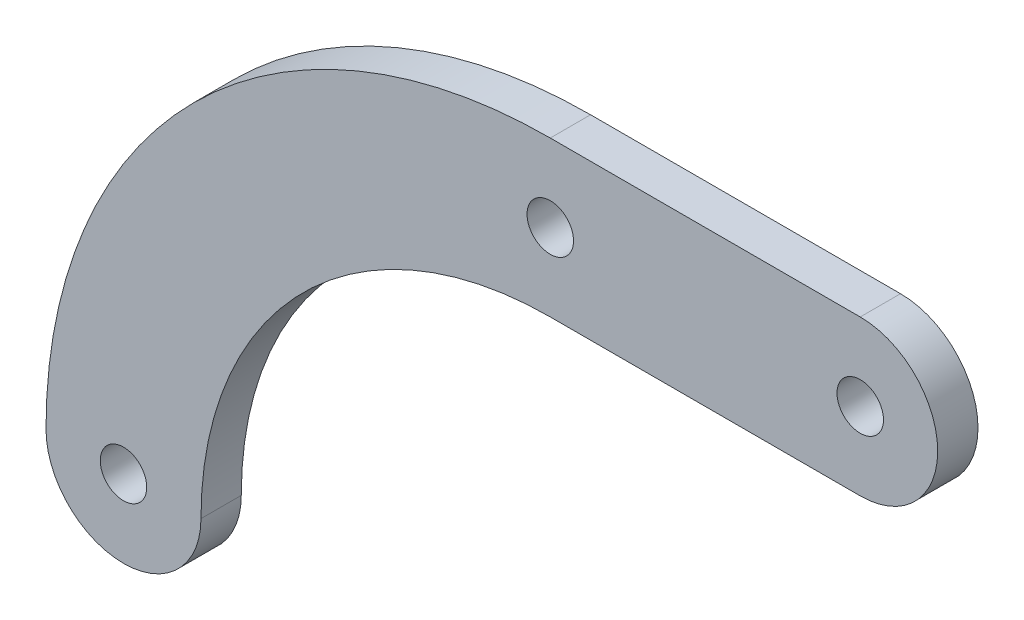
ISO-10303-21;
HEADER;
FILE_DESCRIPTION(('STEP AP214'),'2;1');
FILE_NAME('part.step','',(''),(''),'','','');
FILE_SCHEMA(('AUTOMOTIVE_DESIGN { 1 0 10303 214 1 1 1 1 }'));
ENDSEC;
DATA;
#1=APPLICATION_CONTEXT('core data for automotive mechanical design processes');
#2=APPLICATION_PROTOCOL_DEFINITION('international standard','automotive_design',2000,#1);
#3=PRODUCT_CONTEXT('',#1,'mechanical');
#4=PRODUCT('Part','Part','',(#3));
#5=PRODUCT_RELATED_PRODUCT_CATEGORY('part','',(#4));
#6=PRODUCT_DEFINITION_FORMATION('','',#4);
#7=PRODUCT_DEFINITION_CONTEXT('part definition',#1,'design');
#8=PRODUCT_DEFINITION('design','',#6,#7);
#9=PRODUCT_DEFINITION_SHAPE('','',#8);
#10=(LENGTH_UNIT() NAMED_UNIT(*) SI_UNIT(.MILLI.,.METRE.));
#11=(NAMED_UNIT(*) PLANE_ANGLE_UNIT() SI_UNIT($,.RADIAN.));
#12=(NAMED_UNIT(*) SI_UNIT($,.STERADIAN.) SOLID_ANGLE_UNIT());
#13=UNCERTAINTY_MEASURE_WITH_UNIT(LENGTH_MEASURE(1.E-05),#10,'distance_accuracy_value','');
#14=(GEOMETRIC_REPRESENTATION_CONTEXT(3) GLOBAL_UNCERTAINTY_ASSIGNED_CONTEXT((#13)) GLOBAL_UNIT_ASSIGNED_CONTEXT((#10,
#11,#12)) REPRESENTATION_CONTEXT('',''));
#15=CARTESIAN_POINT('',(0.,0.,0.));
#16=DIRECTION('',(0.,0.,1.));
#17=DIRECTION('',(1.,0.,0.));
#18=AXIS2_PLACEMENT_3D('',#15,#16,#17);
#19=CARTESIAN_POINT('',(-27.54,0.,2.6));
#20=DIRECTION('',(0.,0.,1.));
#21=DIRECTION('',(1.,0.,0.));
#22=AXIS2_PLACEMENT_3D('',#19,#20,#21);
#23=PLANE('',#22);
#24=CARTESIAN_POINT('',(-27.54,0.,2.6));
#25=DIRECTION('',(0.,0.,1.));
#26=DIRECTION('',(1.,0.,0.));
#27=AXIS2_PLACEMENT_3D('',#24,#25,#26);
#28=CIRCLE('',#27,1.5);
#29=CARTESIAN_POINT('',(-26.04,0.,2.6));
#30=VERTEX_POINT('',#29);
#31=EDGE_CURVE('E184',#30,#30,#28,.T.);
#32=ORIENTED_EDGE('',*,*,#31,.F.);
#33=EDGE_LOOP('',(#32));
#34=FACE_BOUND('',#33,.T.);
#35=CARTESIAN_POINT('',(-27.54,0.,2.6));
#36=DIRECTION('',(0.,0.,1.));
#37=DIRECTION('',(1.,0.,0.));
#38=AXIS2_PLACEMENT_3D('',#35,#36,#37);
#39=CIRCLE('',#38,5.);
#40=CARTESIAN_POINT('',(-32.54,0.,2.6));
#41=VERTEX_POINT('',#40);
#42=CARTESIAN_POINT('',(-22.54,0.,2.6));
#43=VERTEX_POINT('',#42);
#44=EDGE_CURVE('E129',#41,#43,#39,.T.);
#45=ORIENTED_EDGE('',*,*,#44,.T.);
#46=CARTESIAN_POINT('',(0.,0.,2.6));
#47=DIRECTION('',(0.,0.,-1.));
#48=DIRECTION('',(1.,0.,0.));
#49=AXIS2_PLACEMENT_3D('',#46,#47,#48);
#50=CIRCLE('',#49,22.54);
#51=CARTESIAN_POINT('',(0.,22.54,2.6));
#52=VERTEX_POINT('',#51);
#53=EDGE_CURVE('E87',#43,#52,#50,.T.);
#54=ORIENTED_EDGE('',*,*,#53,.T.);
#55=DIRECTION('',(1.,0.,0.));
#56=VECTOR('',#55,1.);
#57=CARTESIAN_POINT('',(0.,22.54,2.6));
#58=LINE('',#57,#56);
#59=CARTESIAN_POINT('',(20.,22.54,2.6));
#60=VERTEX_POINT('',#59);
#61=EDGE_CURVE('E100',#52,#60,#58,.T.);
#62=ORIENTED_EDGE('',*,*,#61,.T.);
#63=CARTESIAN_POINT('',(20.,27.54,2.6));
#64=DIRECTION('',(0.,0.,1.));
#65=DIRECTION('',(1.,0.,0.));
#66=AXIS2_PLACEMENT_3D('',#63,#64,#65);
#67=CIRCLE('',#66,5.);
#68=CARTESIAN_POINT('',(20.,32.54,2.6));
#69=VERTEX_POINT('',#68);
#70=EDGE_CURVE('E94',#60,#69,#67,.T.);
#71=ORIENTED_EDGE('',*,*,#70,.T.);
#72=DIRECTION('',(-1.,0.,0.));
#73=VECTOR('',#72,1.);
#74=CARTESIAN_POINT('',(0.,32.54,2.6));
#75=LINE('',#74,#73);
#76=CARTESIAN_POINT('',(0.,32.54,2.6));
#77=VERTEX_POINT('',#76);
#78=EDGE_CURVE('E98',#69,#77,#75,.T.);
#79=ORIENTED_EDGE('',*,*,#78,.T.);
#80=CARTESIAN_POINT('',(0.,0.,2.6));
#81=DIRECTION('',(0.,0.,1.));
#82=DIRECTION('',(1.,0.,0.));
#83=AXIS2_PLACEMENT_3D('',#80,#81,#82);
#84=CIRCLE('',#83,32.54);
#85=EDGE_CURVE('E50',#77,#41,#84,.T.);
#86=ORIENTED_EDGE('',*,*,#85,.T.);
#87=EDGE_LOOP('',(#45,#54,#62,#71,#79,#86));
#88=FACE_BOUND('',#87,.T.);
#89=CARTESIAN_POINT('',(0.,27.54,2.6));
#90=DIRECTION('',(0.,0.,1.));
#91=DIRECTION('',(1.,0.,0.));
#92=AXIS2_PLACEMENT_3D('',#89,#90,#91);
#93=CIRCLE('',#92,1.5);
#94=CARTESIAN_POINT('',(1.5,27.54,2.6));
#95=VERTEX_POINT('',#94);
#96=EDGE_CURVE('E122',#95,#95,#93,.T.);
#97=ORIENTED_EDGE('',*,*,#96,.F.);
#98=EDGE_LOOP('',(#97));
#99=FACE_BOUND('',#98,.T.);
#100=CARTESIAN_POINT('',(20.,27.54,2.6));
#101=DIRECTION('',(0.,0.,1.));
#102=DIRECTION('',(1.,0.,0.));
#103=AXIS2_PLACEMENT_3D('',#100,#101,#102);
#104=CIRCLE('',#103,1.5);
#105=CARTESIAN_POINT('',(21.5,27.54,2.6));
#106=VERTEX_POINT('',#105);
#107=EDGE_CURVE('E175',#106,#106,#104,.T.);
#108=ORIENTED_EDGE('',*,*,#107,.F.);
#109=EDGE_LOOP('',(#108));
#110=FACE_BOUND('',#109,.T.);
#111=ADVANCED_FACE('F33',(#34,#88,#99,#110),#23,.T.);
#112=CARTESIAN_POINT('',(-27.54,0.,0.));
#113=DIRECTION('',(0.,0.,1.));
#114=DIRECTION('',(1.,0.,0.));
#115=AXIS2_PLACEMENT_3D('',#112,#113,#114);
#116=PLANE('',#115);
#117=CARTESIAN_POINT('',(-27.54,0.,0.));
#118=DIRECTION('',(0.,0.,1.));
#119=DIRECTION('',(1.,0.,0.));
#120=AXIS2_PLACEMENT_3D('',#117,#118,#119);
#121=CIRCLE('',#120,5.);
#122=CARTESIAN_POINT('',(-32.54,0.,0.));
#123=VERTEX_POINT('',#122);
#124=CARTESIAN_POINT('',(-22.54,0.,0.));
#125=VERTEX_POINT('',#124);
#126=EDGE_CURVE('E118',#123,#125,#121,.T.);
#127=ORIENTED_EDGE('',*,*,#126,.F.);
#128=CARTESIAN_POINT('',(0.,0.,0.));
#129=DIRECTION('',(0.,0.,1.));
#130=DIRECTION('',(1.,0.,0.));
#131=AXIS2_PLACEMENT_3D('',#128,#129,#130);
#132=CIRCLE('',#131,32.54);
#133=CARTESIAN_POINT('',(0.,32.54,0.));
#134=VERTEX_POINT('',#133);
#135=EDGE_CURVE('E79',#134,#123,#132,.T.);
#136=ORIENTED_EDGE('',*,*,#135,.F.);
#137=DIRECTION('',(-1.,0.,0.));
#138=VECTOR('',#137,1.);
#139=CARTESIAN_POINT('',(0.,32.54,0.));
#140=LINE('',#139,#138);
#141=CARTESIAN_POINT('',(20.,32.54,0.));
#142=VERTEX_POINT('',#141);
#143=EDGE_CURVE('E73',#142,#134,#140,.T.);
#144=ORIENTED_EDGE('',*,*,#143,.F.);
#145=CARTESIAN_POINT('',(20.,27.54,0.));
#146=DIRECTION('',(0.,0.,1.));
#147=DIRECTION('',(1.,0.,0.));
#148=AXIS2_PLACEMENT_3D('',#145,#146,#147);
#149=CIRCLE('',#148,5.);
#150=CARTESIAN_POINT('',(20.,22.54,0.));
#151=VERTEX_POINT('',#150);
#152=EDGE_CURVE('E108',#151,#142,#149,.T.);
#153=ORIENTED_EDGE('',*,*,#152,.F.);
#154=DIRECTION('',(1.,0.,0.));
#155=VECTOR('',#154,1.);
#156=CARTESIAN_POINT('',(0.,22.54,0.));
#157=LINE('',#156,#155);
#158=CARTESIAN_POINT('',(0.,22.54,0.));
#159=VERTEX_POINT('',#158);
#160=EDGE_CURVE('E124',#159,#151,#157,.T.);
#161=ORIENTED_EDGE('',*,*,#160,.F.);
#162=CARTESIAN_POINT('',(0.,0.,0.));
#163=DIRECTION('',(0.,0.,-1.));
#164=DIRECTION('',(1.,0.,0.));
#165=AXIS2_PLACEMENT_3D('',#162,#163,#164);
#166=CIRCLE('',#165,22.54);
#167=EDGE_CURVE('E121',#125,#159,#166,.T.);
#168=ORIENTED_EDGE('',*,*,#167,.F.);
#169=EDGE_LOOP('',(#127,#136,#144,#153,#161,#168));
#170=FACE_BOUND('',#169,.T.);
#171=CARTESIAN_POINT('',(0.,27.54,0.));
#172=DIRECTION('',(0.,0.,1.));
#173=DIRECTION('',(1.,0.,0.));
#174=AXIS2_PLACEMENT_3D('',#171,#172,#173);
#175=CIRCLE('',#174,1.5);
#176=CARTESIAN_POINT('',(1.5,27.54,0.));
#177=VERTEX_POINT('',#176);
#178=EDGE_CURVE('E187',#177,#177,#175,.T.);
#179=ORIENTED_EDGE('',*,*,#178,.T.);
#180=EDGE_LOOP('',(#179));
#181=FACE_BOUND('',#180,.T.);
#182=CARTESIAN_POINT('',(-27.54,0.,0.));
#183=DIRECTION('',(0.,0.,1.));
#184=DIRECTION('',(1.,0.,0.));
#185=AXIS2_PLACEMENT_3D('',#182,#183,#184);
#186=CIRCLE('',#185,1.5);
#187=CARTESIAN_POINT('',(-26.04,0.,0.));
#188=VERTEX_POINT('',#187);
#189=EDGE_CURVE('E181',#188,#188,#186,.T.);
#190=ORIENTED_EDGE('',*,*,#189,.T.);
#191=EDGE_LOOP('',(#190));
#192=FACE_BOUND('',#191,.T.);
#193=CARTESIAN_POINT('',(20.,27.54,0.));
#194=DIRECTION('',(0.,0.,1.));
#195=DIRECTION('',(1.,0.,0.));
#196=AXIS2_PLACEMENT_3D('',#193,#194,#195);
#197=CIRCLE('',#196,1.5);
#198=CARTESIAN_POINT('',(21.5,27.54,0.));
#199=VERTEX_POINT('',#198);
#200=EDGE_CURVE('E178',#199,#199,#197,.T.);
#201=ORIENTED_EDGE('',*,*,#200,.T.);
#202=EDGE_LOOP('',(#201));
#203=FACE_BOUND('',#202,.T.);
#204=ADVANCED_FACE('F138',(#170,#181,#192,#203),#116,.F.);
#205=CARTESIAN_POINT('',(-27.54,0.,2.6));
#206=DIRECTION('',(0.,0.,-1.));
#207=DIRECTION('',(-1.,0.,0.));
#208=AXIS2_PLACEMENT_3D('',#205,#206,#207);
#209=CYLINDRICAL_SURFACE('',#208,5.);
#210=ORIENTED_EDGE('',*,*,#126,.T.);
#211=DIRECTION('',(0.,0.,-1.));
#212=VECTOR('',#211,1.);
#213=CARTESIAN_POINT('',(-22.54,0.,2.6));
#214=LINE('',#213,#212);
#215=EDGE_CURVE('E11',#43,#125,#214,.T.);
#216=ORIENTED_EDGE('',*,*,#215,.F.);
#217=ORIENTED_EDGE('',*,*,#44,.F.);
#218=DIRECTION('',(0.,0.,-1.));
#219=VECTOR('',#218,1.);
#220=CARTESIAN_POINT('',(-32.54,0.,2.6));
#221=LINE('',#220,#219);
#222=EDGE_CURVE('E114',#41,#123,#221,.T.);
#223=ORIENTED_EDGE('',*,*,#222,.T.);
#224=EDGE_LOOP('',(#210,#216,#217,#223));
#225=FACE_BOUND('',#224,.T.);
#226=ADVANCED_FACE('F35',(#225),#209,.T.);
#227=CARTESIAN_POINT('',(0.,0.,2.6));
#228=DIRECTION('',(0.,0.,-1.));
#229=DIRECTION('',(-1.,0.,0.));
#230=AXIS2_PLACEMENT_3D('',#227,#228,#229);
#231=CYLINDRICAL_SURFACE('',#230,22.54);
#232=ORIENTED_EDGE('',*,*,#167,.T.);
#233=DIRECTION('',(0.,0.,-1.));
#234=VECTOR('',#233,1.);
#235=CARTESIAN_POINT('',(0.,22.54,2.6));
#236=LINE('',#235,#234);
#237=EDGE_CURVE('E42',#52,#159,#236,.T.);
#238=ORIENTED_EDGE('',*,*,#237,.F.);
#239=ORIENTED_EDGE('',*,*,#53,.F.);
#240=ORIENTED_EDGE('',*,*,#215,.T.);
#241=EDGE_LOOP('',(#232,#238,#239,#240));
#242=FACE_BOUND('',#241,.T.);
#243=ADVANCED_FACE('F237',(#242),#231,.F.);
#244=CARTESIAN_POINT('',(0.,22.54,2.6));
#245=DIRECTION('',(0.,1.,0.));
#246=DIRECTION('',(0.,0.,1.));
#247=AXIS2_PLACEMENT_3D('',#244,#245,#246);
#248=PLANE('',#247);
#249=ORIENTED_EDGE('',*,*,#160,.T.);
#250=DIRECTION('',(0.,0.,-1.));
#251=VECTOR('',#250,1.);
#252=CARTESIAN_POINT('',(20.,22.54,2.6));
#253=LINE('',#252,#251);
#254=EDGE_CURVE('E109',#60,#151,#253,.T.);
#255=ORIENTED_EDGE('',*,*,#254,.F.);
#256=ORIENTED_EDGE('',*,*,#61,.F.);
#257=ORIENTED_EDGE('',*,*,#237,.T.);
#258=EDGE_LOOP('',(#249,#255,#256,#257));
#259=FACE_BOUND('',#258,.T.);
#260=ADVANCED_FACE('F135',(#259),#248,.F.);
#261=CARTESIAN_POINT('',(20.,27.54,2.6));
#262=DIRECTION('',(0.,0.,-1.));
#263=DIRECTION('',(-1.,0.,0.));
#264=AXIS2_PLACEMENT_3D('',#261,#262,#263);
#265=CYLINDRICAL_SURFACE('',#264,5.);
#266=ORIENTED_EDGE('',*,*,#152,.T.);
#267=DIRECTION('',(0.,0.,-1.));
#268=VECTOR('',#267,1.);
#269=CARTESIAN_POINT('',(20.,32.54,2.6));
#270=LINE('',#269,#268);
#271=EDGE_CURVE('E105',#69,#142,#270,.T.);
#272=ORIENTED_EDGE('',*,*,#271,.F.);
#273=ORIENTED_EDGE('',*,*,#70,.F.);
#274=ORIENTED_EDGE('',*,*,#254,.T.);
#275=EDGE_LOOP('',(#266,#272,#273,#274));
#276=FACE_BOUND('',#275,.T.);
#277=ADVANCED_FACE('F106',(#276),#265,.T.);
#278=CARTESIAN_POINT('',(0.,32.54,2.6));
#279=DIRECTION('',(0.,-1.,0.));
#280=DIRECTION('',(0.,0.,-1.));
#281=AXIS2_PLACEMENT_3D('',#278,#279,#280);
#282=PLANE('',#281);
#283=ORIENTED_EDGE('',*,*,#143,.T.);
#284=DIRECTION('',(0.,0.,-1.));
#285=VECTOR('',#284,1.);
#286=CARTESIAN_POINT('',(0.,32.54,2.6));
#287=LINE('',#286,#285);
#288=EDGE_CURVE('E110',#77,#134,#287,.T.);
#289=ORIENTED_EDGE('',*,*,#288,.F.);
#290=ORIENTED_EDGE('',*,*,#78,.F.);
#291=ORIENTED_EDGE('',*,*,#271,.T.);
#292=EDGE_LOOP('',(#283,#289,#290,#291));
#293=FACE_BOUND('',#292,.T.);
#294=ADVANCED_FACE('F112',(#293),#282,.F.);
#295=CARTESIAN_POINT('',(0.,0.,2.6));
#296=DIRECTION('',(0.,0.,-1.));
#297=DIRECTION('',(-1.,0.,0.));
#298=AXIS2_PLACEMENT_3D('',#295,#296,#297);
#299=CYLINDRICAL_SURFACE('',#298,32.54);
#300=ORIENTED_EDGE('',*,*,#135,.T.);
#301=ORIENTED_EDGE('',*,*,#222,.F.);
#302=ORIENTED_EDGE('',*,*,#85,.F.);
#303=ORIENTED_EDGE('',*,*,#288,.T.);
#304=EDGE_LOOP('',(#300,#301,#302,#303));
#305=FACE_BOUND('',#304,.T.);
#306=ADVANCED_FACE('F143',(#305),#299,.T.);
#307=CARTESIAN_POINT('',(0.,27.54,2.6));
#308=DIRECTION('',(0.,0.,-1.));
#309=DIRECTION('',(-1.,0.,0.));
#310=AXIS2_PLACEMENT_3D('',#307,#308,#309);
#311=CYLINDRICAL_SURFACE('',#310,1.5);
#312=ORIENTED_EDGE('',*,*,#96,.T.);
#313=EDGE_LOOP('',(#312));
#314=FACE_BOUND('',#313,.T.);
#315=ORIENTED_EDGE('',*,*,#178,.F.);
#316=EDGE_LOOP('',(#315));
#317=FACE_BOUND('',#316,.T.);
#318=ADVANCED_FACE('F145',(#314,#317),#311,.F.);
#319=CARTESIAN_POINT('',(-27.54,0.,2.6));
#320=DIRECTION('',(0.,0.,-1.));
#321=DIRECTION('',(-1.,0.,0.));
#322=AXIS2_PLACEMENT_3D('',#319,#320,#321);
#323=CYLINDRICAL_SURFACE('',#322,1.5);
#324=ORIENTED_EDGE('',*,*,#31,.T.);
#325=EDGE_LOOP('',(#324));
#326=FACE_BOUND('',#325,.T.);
#327=ORIENTED_EDGE('',*,*,#189,.F.);
#328=EDGE_LOOP('',(#327));
#329=FACE_BOUND('',#328,.T.);
#330=ADVANCED_FACE('F151',(#326,#329),#323,.F.);
#331=CARTESIAN_POINT('',(20.,27.54,2.6));
#332=DIRECTION('',(0.,0.,-1.));
#333=DIRECTION('',(-1.,0.,0.));
#334=AXIS2_PLACEMENT_3D('',#331,#332,#333);
#335=CYLINDRICAL_SURFACE('',#334,1.5);
#336=ORIENTED_EDGE('',*,*,#107,.T.);
#337=EDGE_LOOP('',(#336));
#338=FACE_BOUND('',#337,.T.);
#339=ORIENTED_EDGE('',*,*,#200,.F.);
#340=EDGE_LOOP('',(#339));
#341=FACE_BOUND('',#340,.T.);
#342=ADVANCED_FACE('F166',(#338,#341),#335,.F.);
#343=CLOSED_SHELL('',(#111,#204,#226,#243,#260,#277,#294,#306,#318,#330,#342));
#344=MANIFOLD_SOLID_BREP('B2',#343);
#345=ADVANCED_BREP_SHAPE_REPRESENTATION('',(#18,#344),#14);
#346=SHAPE_DEFINITION_REPRESENTATION(#9,#345);
ENDSEC;
END-ISO-10303-21;
